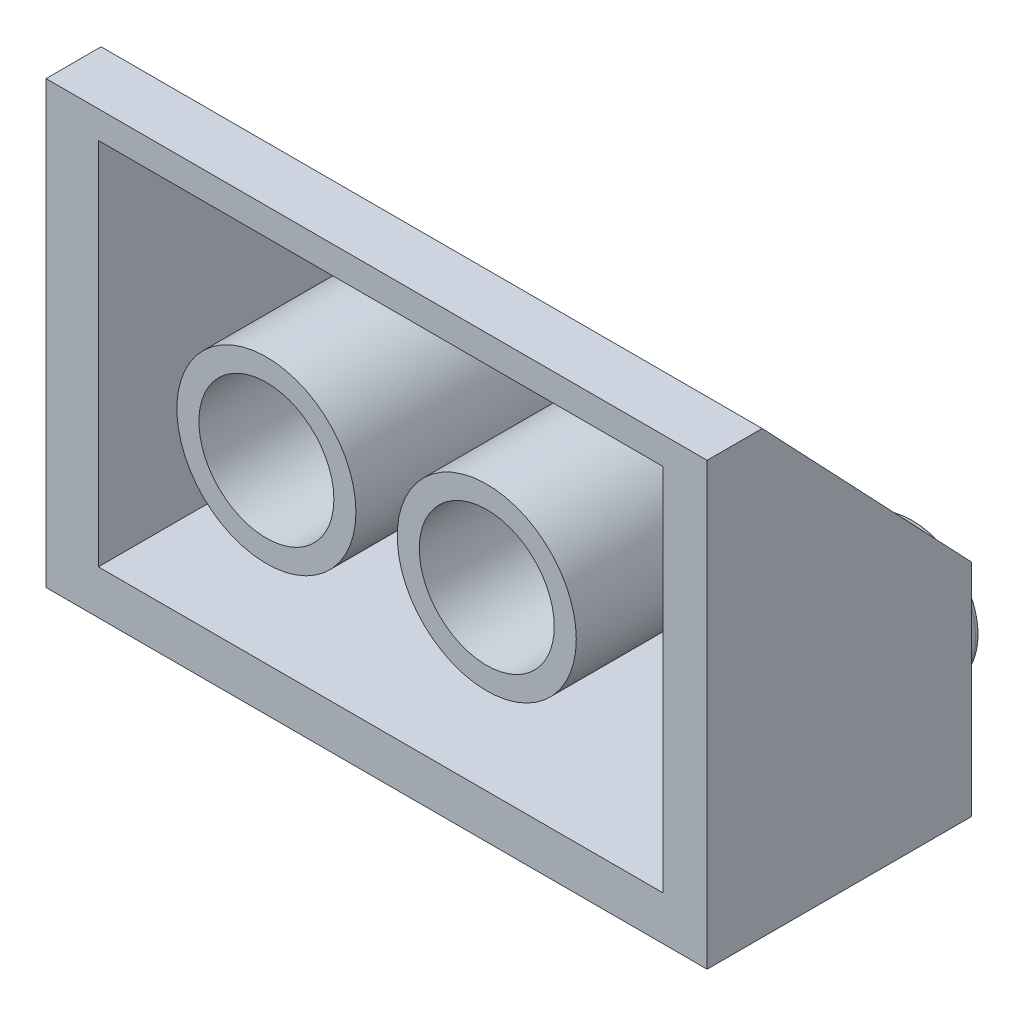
from build123d import *

# Parameters (mm, degrees)
SKIZZE1_W                         = 24
SKIZZE1_H                         = 8
LINEAR_AUSTRAGEN1_DEPTH           = 9.6
SKIZZE2_W                         = 20.5
SKIZZE2_H                         = 12.6
SCHNITT_LINEAR_AUSTRAGEN1_DEPTH   = 8.5
SKIZZE4_R                         = 2.45
LINEAR_AUSTRAGEN3_DEPTH           = 1.9
VERRUNDUNG1_R                     = 0.2
LINEAR_AUSTRAGEN4_DEPTH           = 24
SCHNITT_LINEAR_AUSTRAGEN2_DEPTH   = 20.5
SKIZZE3_R                         = 3.25
SKIZZE3_R_2                       = 2.45
LINEAR_AUSTRAGEN2_DEPTH           = 8.5
SKIZZE8_R                         = 1.25
SCHNITT_LINEAR_AUSTRAGEN3_DEPTH   = 1.8
LINEARES_MUSTER3_COUNT            = 3
LINEARES_MUSTER3_PITCH            = 8
VERRUNDUNG1_OF_LINEARES_MUSTER3_R = 0.2
LINEARES_MUSTER4_COUNT            = 2
LINEARES_MUSTER4_PITCH            = 8
SCHNITT_LINEAR_AUSTRAGEN4_DEPTH   = 24


with BuildPart() as part:
    # Skizze1 → Linear austragen1 (new body)
    with BuildSketch(Plane.XY):
        with Locations((-12, -4)):
            Rectangle(SKIZZE1_W, SKIZZE1_H)
    extrude(amount=LINEAR_AUSTRAGEN1_DEPTH)

    # Skizze2 → Schnitt-Linear austragen1 (cut)
    with BuildSketch(Plane.XY.offset(9.6)):
        with Locations((-11.85, -0.1)):
            Rectangle(SKIZZE2_W, SKIZZE2_H)
    extrude(amount=-SCHNITT_LINEAR_AUSTRAGEN1_DEPTH, mode=Mode.SUBTRACT)

    # Skizze4 → Linear austragen3 (add)
    with BuildSketch(Plane(origin=(0, 0, 0), x_dir=(-1, 0, 0), z_dir=(0, 0, -1))):
        with Locations(Location((4, -4, 0), (0, 0, 180))):
            Circle(SKIZZE4_R)
    linear_austragen3 = extrude(amount=LINEAR_AUSTRAGEN3_DEPTH)

    # Verrundung1
    verrundung1_edges = [part.edges().sort_by_distance(p)[0] for p in [
        (-6.45, -4, -1.9),
    ]]
    fillet(verrundung1_edges, radius=VERRUNDUNG1_R)

    # Skizze6 → Linear austragen4 (add)
    with BuildSketch(Plane(origin=(0, 0, 0), x_dir=(0, 0, -1), z_dir=(1, 0, 0))):
        Polygon((0, 0), (-7.6, 8), (-9.6, 8), (-9.6, 0), align=None)
    extrude(amount=-LINEAR_AUSTRAGEN4_DEPTH)

    # Skizze7 → Schnitt-Linear austragen2 (cut)
    with BuildSketch(Plane(origin=(-22.1, 0, 0), x_dir=(0, 0, -1), z_dir=(1, 0, 0))):
        Polygon((-1.1, 0), (-7.8, 7.005224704), (-9.6, 7.005224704), (-9.6, 0), align=None)
    extrude(amount=SCHNITT_LINEAR_AUSTRAGEN2_DEPTH, mode=Mode.SUBTRACT)

    # Skizze3 → Linear austragen2 (add)
    with BuildSketch(Plane.XY.offset(9.6)):
        with Locations((-8, 0)):
            Circle(SKIZZE3_R)
        with Locations((-8, 0)):
            Circle(SKIZZE3_R_2, mode=Mode.SUBTRACT)
    linear_austragen2 = extrude(amount=-LINEAR_AUSTRAGEN2_DEPTH)

    # Skizze8 → Schnitt-Linear austragen3 (cut)
    with BuildSketch(Plane.XY.offset(1.1)):
        with Locations((-4, -4)):
            Circle(SKIZZE8_R)
    schnitt_linear_austragen3 = extrude(amount=-SCHNITT_LINEAR_AUSTRAGEN3_DEPTH, mode=Mode.SUBTRACT)

    # Lineares Muster3: Linear austragen3, Schnitt-Linear austragen3 ×3
    with Locations(*[(-i * LINEARES_MUSTER3_PITCH, 0, 0) for i in range(1, LINEARES_MUSTER3_COUNT)]):
        add(linear_austragen3)
        add(schnitt_linear_austragen3, mode=Mode.SUBTRACT)

    # Verrundung1 of Lineares Muster3
    verrundung1_of_lineares_muster3_edges = [part.edges().sort_by_distance(p)[0] for p in [
        (-14.45, -4, -1.9),
        (-22.45, -4, -1.9),
    ]]
    fillet(verrundung1_of_lineares_muster3_edges, radius=VERRUNDUNG1_OF_LINEARES_MUSTER3_R)

    # Lineares Muster4: Linear austragen2 ×2
    with Locations(*[(-i * LINEARES_MUSTER4_PITCH, 0, 0) for i in range(1, LINEARES_MUSTER4_COUNT)]):
        add(linear_austragen2)

    # Skizze10 → Schnitt-Linear austragen4 (cut)
    with BuildSketch(Plane.ZY.offset(24)):
        Polygon((1.1, 1.157894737), (3.0875, 3.25), (1.1, 3.25), align=None)
    extrude(amount=-SCHNITT_LINEAR_AUSTRAGEN4_DEPTH, mode=Mode.SUBTRACT)


solid = part.part
